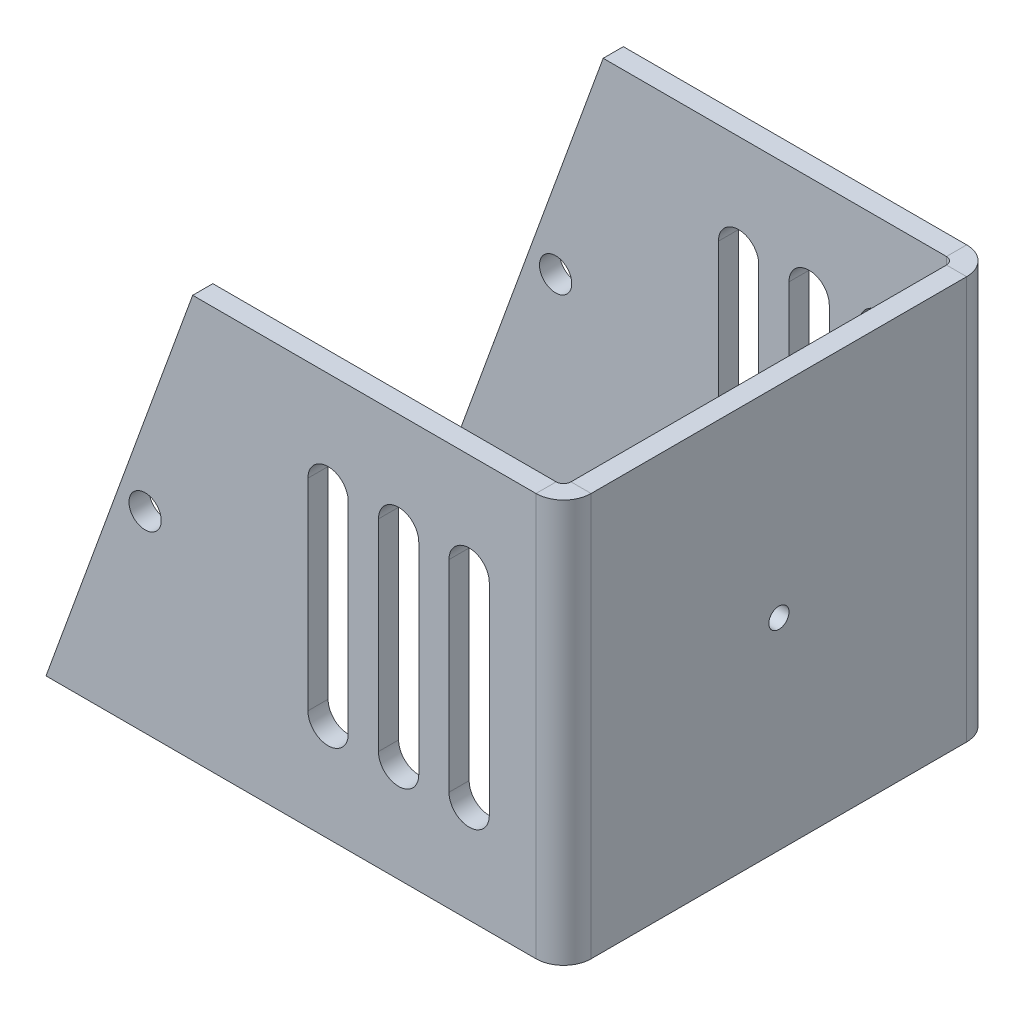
ISO-10303-21;
HEADER;
FILE_DESCRIPTION(('STEP AP214'),'2;1');
FILE_NAME('part.step','',(''),(''),'','','');
FILE_SCHEMA(('AUTOMOTIVE_DESIGN { 1 0 10303 214 1 1 1 1 }'));
ENDSEC;
DATA;
#1=APPLICATION_CONTEXT('core data for automotive mechanical design processes');
#2=APPLICATION_PROTOCOL_DEFINITION('international standard','automotive_design',2000,#1);
#3=PRODUCT_CONTEXT('',#1,'mechanical');
#4=PRODUCT('Part','Part','',(#3));
#5=PRODUCT_RELATED_PRODUCT_CATEGORY('part','',(#4));
#6=PRODUCT_DEFINITION_FORMATION('','',#4);
#7=PRODUCT_DEFINITION_CONTEXT('part definition',#1,'design');
#8=PRODUCT_DEFINITION('design','',#6,#7);
#9=PRODUCT_DEFINITION_SHAPE('','',#8);
#10=(LENGTH_UNIT() NAMED_UNIT(*) SI_UNIT(.MILLI.,.METRE.));
#11=(NAMED_UNIT(*) PLANE_ANGLE_UNIT() SI_UNIT($,.RADIAN.));
#12=(NAMED_UNIT(*) SI_UNIT($,.STERADIAN.) SOLID_ANGLE_UNIT());
#13=UNCERTAINTY_MEASURE_WITH_UNIT(LENGTH_MEASURE(1.E-05),#10,'distance_accuracy_value','');
#14=(GEOMETRIC_REPRESENTATION_CONTEXT(3) GLOBAL_UNCERTAINTY_ASSIGNED_CONTEXT((#13)) GLOBAL_UNIT_ASSIGNED_CONTEXT((#10,
#11,#12)) REPRESENTATION_CONTEXT('',''));
#15=CARTESIAN_POINT('',(0.,0.,0.));
#16=DIRECTION('',(0.,0.,1.));
#17=DIRECTION('',(1.,0.,0.));
#18=AXIS2_PLACEMENT_3D('',#15,#16,#17);
#19=CARTESIAN_POINT('',(51.3726775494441,40.000211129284,-34.0684362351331));
#20=DIRECTION('',(1.,0.,0.));
#21=DIRECTION('',(0.,0.,-1.));
#22=AXIS2_PLACEMENT_3D('',#19,#20,#21);
#23=PLANE('',#22);
#24=CARTESIAN_POINT('',(51.3726775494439,20.,21.372677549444));
#25=DIRECTION('',(-1.,0.,0.));
#26=DIRECTION('',(0.,0.,1.));
#27=AXIS2_PLACEMENT_3D('',#24,#25,#26);
#28=CIRCLE('',#27,0.999999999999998);
#29=CARTESIAN_POINT('',(51.3726775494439,20.,22.372677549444));
#30=VERTEX_POINT('',#29);
#31=EDGE_CURVE('E337',#30,#30,#28,.T.);
#32=ORIENTED_EDGE('',*,*,#31,.T.);
#33=EDGE_LOOP('',(#32));
#34=FACE_BOUND('',#33,.T.);
#35=DIRECTION('',(0.,0.,-1.));
#36=VECTOR('',#35,1.);
#37=CARTESIAN_POINT('',(51.3726775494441,40.000211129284,-34.0684362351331));
#38=LINE('',#37,#36);
#39=CARTESIAN_POINT('',(51.3726775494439,40.000211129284,40.008755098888));
#40=VERTEX_POINT('',#39);
#41=CARTESIAN_POINT('',(51.3726775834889,40.000211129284,2.73660000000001));
#42=VERTEX_POINT('',#41);
#43=EDGE_CURVE('E58',#40,#42,#38,.T.);
#44=ORIENTED_EDGE('',*,*,#43,.F.);
#45=DIRECTION('',(0.,-1.,0.));
#46=VECTOR('',#45,1.);
#47=CARTESIAN_POINT('',(51.3726775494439,40.000211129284,40.008755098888));
#48=LINE('',#47,#46);
#49=CARTESIAN_POINT('',(51.3726775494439,0.,40.008755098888));
#50=VERTEX_POINT('',#49);
#51=EDGE_CURVE('E50',#40,#50,#48,.T.);
#52=ORIENTED_EDGE('',*,*,#51,.T.);
#53=DIRECTION('',(0.,0.,1.));
#54=VECTOR('',#53,1.);
#55=CARTESIAN_POINT('',(51.3726775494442,0.,-48.627322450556));
#56=LINE('',#55,#54);
#57=CARTESIAN_POINT('',(51.372677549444,0.,2.73660000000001));
#58=VERTEX_POINT('',#57);
#59=EDGE_CURVE('E66',#58,#50,#56,.T.);
#60=ORIENTED_EDGE('',*,*,#59,.F.);
#61=DIRECTION('',(0.,-1.,0.));
#62=VECTOR('',#61,1.);
#63=CARTESIAN_POINT('',(51.372677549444,40.000211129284,2.73660000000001));
#64=LINE('',#63,#62);
#65=EDGE_CURVE('E471',#42,#58,#64,.T.);
#66=ORIENTED_EDGE('',*,*,#65,.F.);
#67=EDGE_LOOP('',(#44,#52,#60,#66));
#68=FACE_BOUND('',#67,.T.);
#69=ADVANCED_FACE('F41',(#34,#68),#23,.T.);
#70=CARTESIAN_POINT('',(49.3726775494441,40.000211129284,-34.0684362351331));
#71=DIRECTION('',(0.,-1.,0.));
#72=DIRECTION('',(1.,0.,0.));
#73=AXIS2_PLACEMENT_3D('',#70,#71,#72);
#74=PLANE('',#73);
#75=DIRECTION('',(-1.,0.,0.));
#76=VECTOR('',#75,1.);
#77=CARTESIAN_POINT('',(49.3726775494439,40.000211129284,40.008755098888));
#78=LINE('',#77,#76);
#79=CARTESIAN_POINT('',(49.3726775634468,40.000211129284,40.008755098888));
#80=VERTEX_POINT('',#79);
#81=EDGE_CURVE('E12',#40,#80,#78,.T.);
#82=ORIENTED_EDGE('',*,*,#81,.F.);
#83=ORIENTED_EDGE('',*,*,#43,.T.);
#84=DIRECTION('',(-1.,0.,0.));
#85=VECTOR('',#84,1.);
#86=CARTESIAN_POINT('',(49.372677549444,40.000211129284,2.73660000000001));
#87=LINE('',#86,#85);
#88=CARTESIAN_POINT('',(49.3726776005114,40.000211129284,2.7366));
#89=VERTEX_POINT('',#88);
#90=EDGE_CURVE('E468',#42,#89,#87,.T.);
#91=ORIENTED_EDGE('',*,*,#90,.T.);
#92=DIRECTION('',(0.,0.,-1.));
#93=VECTOR('',#92,1.);
#94=CARTESIAN_POINT('',(49.3726775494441,40.000211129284,-34.0684362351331));
#95=LINE('',#94,#93);
#96=EDGE_CURVE('E45',#80,#89,#95,.T.);
#97=ORIENTED_EDGE('',*,*,#96,.F.);
#98=EDGE_LOOP('',(#82,#83,#91,#97));
#99=FACE_BOUND('',#98,.T.);
#100=ADVANCED_FACE('F43',(#99),#74,.F.);
#101=CARTESIAN_POINT('',(49.3726775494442,0.,-48.627322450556));
#102=DIRECTION('',(0.,1.,0.));
#103=DIRECTION('',(-1.,0.,0.));
#104=AXIS2_PLACEMENT_3D('',#101,#102,#103);
#105=PLANE('',#104);
#106=DIRECTION('',(1.,0.,0.));
#107=VECTOR('',#106,1.);
#108=CARTESIAN_POINT('',(49.3726775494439,0.,40.008755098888));
#109=LINE('',#108,#107);
#110=CARTESIAN_POINT('',(49.3726775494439,0.,40.008755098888));
#111=VERTEX_POINT('',#110);
#112=EDGE_CURVE('E478',#111,#50,#109,.T.);
#113=ORIENTED_EDGE('',*,*,#112,.F.);
#114=DIRECTION('',(0.,0.,1.));
#115=VECTOR('',#114,1.);
#116=CARTESIAN_POINT('',(49.3726775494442,0.,-48.627322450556));
#117=LINE('',#116,#115);
#118=CARTESIAN_POINT('',(49.3726776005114,0.,2.7366));
#119=VERTEX_POINT('',#118);
#120=EDGE_CURVE('E483',#119,#111,#117,.T.);
#121=ORIENTED_EDGE('',*,*,#120,.F.);
#122=DIRECTION('',(1.,0.,0.));
#123=VECTOR('',#122,1.);
#124=CARTESIAN_POINT('',(49.372677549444,0.,2.73660000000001));
#125=LINE('',#124,#123);
#126=EDGE_CURVE('E473',#119,#58,#125,.T.);
#127=ORIENTED_EDGE('',*,*,#126,.T.);
#128=ORIENTED_EDGE('',*,*,#59,.T.);
#129=EDGE_LOOP('',(#113,#121,#127,#128));
#130=FACE_BOUND('',#129,.T.);
#131=ADVANCED_FACE('F538',(#130),#105,.F.);
#132=CARTESIAN_POINT('',(49.3726775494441,40.000211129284,-34.0684362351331));
#133=DIRECTION('',(1.,0.,0.));
#134=DIRECTION('',(0.,0.,-1.));
#135=AXIS2_PLACEMENT_3D('',#132,#133,#134);
#136=PLANE('',#135);
#137=DIRECTION('',(0.,-1.,0.));
#138=VECTOR('',#137,1.);
#139=CARTESIAN_POINT('',(49.3726775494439,40.000211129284,40.008755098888));
#140=LINE('',#139,#138);
#141=EDGE_CURVE('E475',#80,#111,#140,.T.);
#142=ORIENTED_EDGE('',*,*,#141,.F.);
#143=ORIENTED_EDGE('',*,*,#96,.T.);
#144=DIRECTION('',(0.,-1.,0.));
#145=VECTOR('',#144,1.);
#146=CARTESIAN_POINT('',(49.372677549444,40.000211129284,2.73660000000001));
#147=LINE('',#146,#145);
#148=EDGE_CURVE('E465',#89,#119,#147,.T.);
#149=ORIENTED_EDGE('',*,*,#148,.T.);
#150=ORIENTED_EDGE('',*,*,#120,.T.);
#151=EDGE_LOOP('',(#142,#143,#149,#150));
#152=FACE_BOUND('',#151,.T.);
#153=CARTESIAN_POINT('',(49.3726775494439,20.,21.372677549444));
#154=DIRECTION('',(-1.,0.,0.));
#155=DIRECTION('',(0.,0.,1.));
#156=AXIS2_PLACEMENT_3D('',#153,#154,#155);
#157=CIRCLE('',#156,0.999999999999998);
#158=CARTESIAN_POINT('',(49.3726775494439,20.,22.372677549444));
#159=VERTEX_POINT('',#158);
#160=EDGE_CURVE('E462',#159,#159,#157,.T.);
#161=ORIENTED_EDGE('',*,*,#160,.F.);
#162=EDGE_LOOP('',(#161));
#163=FACE_BOUND('',#162,.T.);
#164=ADVANCED_FACE('F488',(#152,#163),#136,.F.);
#165=CARTESIAN_POINT('',(49.3726775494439,20.,21.372677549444));
#166=DIRECTION('',(1.,0.,0.));
#167=DIRECTION('',(0.,0.,-1.));
#168=AXIS2_PLACEMENT_3D('',#165,#166,#167);
#169=CYLINDRICAL_SURFACE('',#168,0.999999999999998);
#170=ORIENTED_EDGE('',*,*,#160,.T.);
#171=EDGE_LOOP('',(#170));
#172=FACE_BOUND('',#171,.T.);
#173=ORIENTED_EDGE('',*,*,#31,.F.);
#174=EDGE_LOOP('',(#173));
#175=FACE_BOUND('',#174,.T.);
#176=ADVANCED_FACE('F544',(#172,#175),#169,.F.);
#177=CARTESIAN_POINT('',(9.83646703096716,19.0694249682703,2.));
#178=DIRECTION('',(0.,0.,-1.));
#179=DIRECTION('',(-1.,0.,0.));
#180=AXIS2_PLACEMENT_3D('',#177,#178,#179);
#181=CYLINDRICAL_SURFACE('',#180,1.6);
#182=CARTESIAN_POINT('',(9.83646703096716,19.0694249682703,2.));
#183=DIRECTION('',(0.,0.,1.));
#184=DIRECTION('',(1.,0.,0.));
#185=AXIS2_PLACEMENT_3D('',#182,#183,#184);
#186=CIRCLE('',#185,1.6);
#187=CARTESIAN_POINT('',(11.4364670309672,19.0694249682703,2.));
#188=VERTEX_POINT('',#187);
#189=EDGE_CURVE('E449',#188,#188,#186,.T.);
#190=ORIENTED_EDGE('',*,*,#189,.T.);
#191=EDGE_LOOP('',(#190));
#192=FACE_BOUND('',#191,.T.);
#193=CARTESIAN_POINT('',(9.83646703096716,19.0694249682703,0.));
#194=DIRECTION('',(0.,0.,1.));
#195=DIRECTION('',(1.,0.,0.));
#196=AXIS2_PLACEMENT_3D('',#193,#194,#195);
#197=CIRCLE('',#196,1.6);
#198=CARTESIAN_POINT('',(11.4364670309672,19.0694249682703,0.));
#199=VERTEX_POINT('',#198);
#200=EDGE_CURVE('E344',#199,#199,#197,.T.);
#201=ORIENTED_EDGE('',*,*,#200,.F.);
#202=EDGE_LOOP('',(#201));
#203=FACE_BOUND('',#202,.T.);
#204=ADVANCED_FACE('F547',(#192,#203),#181,.F.);
#205=CARTESIAN_POINT('',(42.,10.,-8.));
#206=DIRECTION('',(0.,0.,1.));
#207=DIRECTION('',(1.,0.,0.));
#208=AXIS2_PLACEMENT_3D('',#205,#206,#207);
#209=CYLINDRICAL_SURFACE('',#208,2.);
#210=CARTESIAN_POINT('',(42.,10.,0.));
#211=DIRECTION('',(0.,0.,-1.));
#212=DIRECTION('',(-1.,0.,0.));
#213=AXIS2_PLACEMENT_3D('',#210,#211,#212);
#214=CIRCLE('',#213,2.);
#215=CARTESIAN_POINT('',(44.,10.,0.));
#216=VERTEX_POINT('',#215);
#217=CARTESIAN_POINT('',(40.,10.,0.));
#218=VERTEX_POINT('',#217);
#219=EDGE_CURVE('E446',#216,#218,#214,.T.);
#220=ORIENTED_EDGE('',*,*,#219,.T.);
#221=DIRECTION('',(0.,0.,1.));
#222=VECTOR('',#221,1.);
#223=CARTESIAN_POINT('',(40.,10.,-8.));
#224=LINE('',#223,#222);
#225=CARTESIAN_POINT('',(40.,10.,2.));
#226=VERTEX_POINT('',#225);
#227=EDGE_CURVE('E444',#218,#226,#224,.T.);
#228=ORIENTED_EDGE('',*,*,#227,.T.);
#229=CARTESIAN_POINT('',(42.,10.,2.));
#230=DIRECTION('',(0.,0.,1.));
#231=DIRECTION('',(-1.,0.,0.));
#232=AXIS2_PLACEMENT_3D('',#229,#230,#231);
#233=CIRCLE('',#232,2.);
#234=CARTESIAN_POINT('',(44.,10.,2.));
#235=VERTEX_POINT('',#234);
#236=EDGE_CURVE('E441',#226,#235,#233,.T.);
#237=ORIENTED_EDGE('',*,*,#236,.T.);
#238=DIRECTION('',(0.,0.,1.));
#239=VECTOR('',#238,1.);
#240=CARTESIAN_POINT('',(44.,10.,-8.));
#241=LINE('',#240,#239);
#242=EDGE_CURVE('E437',#216,#235,#241,.T.);
#243=ORIENTED_EDGE('',*,*,#242,.F.);
#244=EDGE_LOOP('',(#220,#228,#237,#243));
#245=FACE_BOUND('',#244,.T.);
#246=ADVANCED_FACE('F801',(#245),#209,.F.);
#247=CARTESIAN_POINT('',(44.,30.000211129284,-8.));
#248=DIRECTION('',(1.,0.,0.));
#249=DIRECTION('',(0.,0.,-1.));
#250=AXIS2_PLACEMENT_3D('',#247,#248,#249);
#251=PLANE('',#250);
#252=DIRECTION('',(0.,-1.,0.));
#253=VECTOR('',#252,1.);
#254=CARTESIAN_POINT('',(44.,40.000211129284,0.));
#255=LINE('',#254,#253);
#256=CARTESIAN_POINT('',(44.,30.000211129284,0.));
#257=VERTEX_POINT('',#256);
#258=EDGE_CURVE('E439',#257,#216,#255,.T.);
#259=ORIENTED_EDGE('',*,*,#258,.T.);
#260=ORIENTED_EDGE('',*,*,#242,.T.);
#261=DIRECTION('',(0.,1.,0.));
#262=VECTOR('',#261,1.);
#263=CARTESIAN_POINT('',(44.,30.000211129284,2.));
#264=LINE('',#263,#262);
#265=CARTESIAN_POINT('',(44.,30.000211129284,2.));
#266=VERTEX_POINT('',#265);
#267=EDGE_CURVE('E434',#235,#266,#264,.T.);
#268=ORIENTED_EDGE('',*,*,#267,.T.);
#269=DIRECTION('',(0.,0.,1.));
#270=VECTOR('',#269,1.);
#271=CARTESIAN_POINT('',(44.,30.000211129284,-8.));
#272=LINE('',#271,#270);
#273=EDGE_CURVE('E430',#257,#266,#272,.T.);
#274=ORIENTED_EDGE('',*,*,#273,.F.);
#275=EDGE_LOOP('',(#259,#260,#268,#274));
#276=FACE_BOUND('',#275,.T.);
#277=ADVANCED_FACE('F809',(#276),#251,.F.);
#278=CARTESIAN_POINT('',(42.,30.000211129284,-8.));
#279=DIRECTION('',(0.,0.,1.));
#280=DIRECTION('',(1.,0.,0.));
#281=AXIS2_PLACEMENT_3D('',#278,#279,#280);
#282=CYLINDRICAL_SURFACE('',#281,2.);
#283=CARTESIAN_POINT('',(42.,30.000211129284,0.));
#284=DIRECTION('',(0.,0.,-1.));
#285=DIRECTION('',(-1.,0.,0.));
#286=AXIS2_PLACEMENT_3D('',#283,#284,#285);
#287=CIRCLE('',#286,2.);
#288=CARTESIAN_POINT('',(40.,30.000211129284,0.));
#289=VERTEX_POINT('',#288);
#290=EDGE_CURVE('E432',#289,#257,#287,.T.);
#291=ORIENTED_EDGE('',*,*,#290,.T.);
#292=ORIENTED_EDGE('',*,*,#273,.T.);
#293=CARTESIAN_POINT('',(42.,30.000211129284,2.));
#294=DIRECTION('',(0.,0.,1.));
#295=DIRECTION('',(-1.,0.,0.));
#296=AXIS2_PLACEMENT_3D('',#293,#294,#295);
#297=CIRCLE('',#296,2.);
#298=CARTESIAN_POINT('',(40.,30.000211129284,2.));
#299=VERTEX_POINT('',#298);
#300=EDGE_CURVE('E428',#266,#299,#297,.T.);
#301=ORIENTED_EDGE('',*,*,#300,.T.);
#302=DIRECTION('',(0.,0.,1.));
#303=VECTOR('',#302,1.);
#304=CARTESIAN_POINT('',(40.,30.000211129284,-8.));
#305=LINE('',#304,#303);
#306=EDGE_CURVE('E423',#289,#299,#305,.T.);
#307=ORIENTED_EDGE('',*,*,#306,.F.);
#308=EDGE_LOOP('',(#291,#292,#301,#307));
#309=FACE_BOUND('',#308,.T.);
#310=ADVANCED_FACE('F817',(#309),#282,.F.);
#311=CARTESIAN_POINT('',(40.,30.000211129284,-8.));
#312=DIRECTION('',(-1.,0.,0.));
#313=DIRECTION('',(0.,0.,1.));
#314=AXIS2_PLACEMENT_3D('',#311,#312,#313);
#315=PLANE('',#314);
#316=DIRECTION('',(0.,1.,0.));
#317=VECTOR('',#316,1.);
#318=CARTESIAN_POINT('',(40.,40.000211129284,0.));
#319=LINE('',#318,#317);
#320=EDGE_CURVE('E426',#218,#289,#319,.T.);
#321=ORIENTED_EDGE('',*,*,#320,.T.);
#322=ORIENTED_EDGE('',*,*,#306,.T.);
#323=DIRECTION('',(0.,-1.,0.));
#324=VECTOR('',#323,1.);
#325=CARTESIAN_POINT('',(40.,30.000211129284,2.));
#326=LINE('',#325,#324);
#327=EDGE_CURVE('E420',#299,#226,#326,.T.);
#328=ORIENTED_EDGE('',*,*,#327,.T.);
#329=ORIENTED_EDGE('',*,*,#227,.F.);
#330=EDGE_LOOP('',(#321,#322,#328,#329));
#331=FACE_BOUND('',#330,.T.);
#332=ADVANCED_FACE('F825',(#331),#315,.F.);
#333=CARTESIAN_POINT('',(35.,10.,-8.));
#334=DIRECTION('',(0.,0.,1.));
#335=DIRECTION('',(1.,0.,0.));
#336=AXIS2_PLACEMENT_3D('',#333,#334,#335);
#337=CYLINDRICAL_SURFACE('',#336,2.);
#338=CARTESIAN_POINT('',(35.,10.,0.));
#339=DIRECTION('',(0.,0.,-1.));
#340=DIRECTION('',(-1.,0.,0.));
#341=AXIS2_PLACEMENT_3D('',#338,#339,#340);
#342=CIRCLE('',#341,2.);
#343=CARTESIAN_POINT('',(37.,10.,0.));
#344=VERTEX_POINT('',#343);
#345=CARTESIAN_POINT('',(33.,10.,0.));
#346=VERTEX_POINT('',#345);
#347=EDGE_CURVE('E417',#344,#346,#342,.T.);
#348=ORIENTED_EDGE('',*,*,#347,.T.);
#349=DIRECTION('',(0.,0.,1.));
#350=VECTOR('',#349,1.);
#351=CARTESIAN_POINT('',(33.,10.,-8.));
#352=LINE('',#351,#350);
#353=CARTESIAN_POINT('',(33.,10.,2.));
#354=VERTEX_POINT('',#353);
#355=EDGE_CURVE('E415',#346,#354,#352,.T.);
#356=ORIENTED_EDGE('',*,*,#355,.T.);
#357=CARTESIAN_POINT('',(35.,10.,2.));
#358=DIRECTION('',(0.,0.,1.));
#359=DIRECTION('',(-1.,0.,0.));
#360=AXIS2_PLACEMENT_3D('',#357,#358,#359);
#361=CIRCLE('',#360,2.);
#362=CARTESIAN_POINT('',(37.,10.,2.));
#363=VERTEX_POINT('',#362);
#364=EDGE_CURVE('E412',#354,#363,#361,.T.);
#365=ORIENTED_EDGE('',*,*,#364,.T.);
#366=DIRECTION('',(0.,0.,1.));
#367=VECTOR('',#366,1.);
#368=CARTESIAN_POINT('',(37.,10.,-8.));
#369=LINE('',#368,#367);
#370=EDGE_CURVE('E408',#344,#363,#369,.T.);
#371=ORIENTED_EDGE('',*,*,#370,.F.);
#372=EDGE_LOOP('',(#348,#356,#365,#371));
#373=FACE_BOUND('',#372,.T.);
#374=ADVANCED_FACE('F833',(#373),#337,.F.);
#375=CARTESIAN_POINT('',(37.,30.000211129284,-8.));
#376=DIRECTION('',(1.,0.,0.));
#377=DIRECTION('',(0.,0.,-1.));
#378=AXIS2_PLACEMENT_3D('',#375,#376,#377);
#379=PLANE('',#378);
#380=DIRECTION('',(0.,-1.,0.));
#381=VECTOR('',#380,1.);
#382=CARTESIAN_POINT('',(37.,40.000211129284,0.));
#383=LINE('',#382,#381);
#384=CARTESIAN_POINT('',(37.,30.000211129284,0.));
#385=VERTEX_POINT('',#384);
#386=EDGE_CURVE('E410',#385,#344,#383,.T.);
#387=ORIENTED_EDGE('',*,*,#386,.T.);
#388=ORIENTED_EDGE('',*,*,#370,.T.);
#389=DIRECTION('',(0.,1.,0.));
#390=VECTOR('',#389,1.);
#391=CARTESIAN_POINT('',(37.,30.000211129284,2.));
#392=LINE('',#391,#390);
#393=CARTESIAN_POINT('',(37.,30.000211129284,2.));
#394=VERTEX_POINT('',#393);
#395=EDGE_CURVE('E405',#363,#394,#392,.T.);
#396=ORIENTED_EDGE('',*,*,#395,.T.);
#397=DIRECTION('',(0.,0.,1.));
#398=VECTOR('',#397,1.);
#399=CARTESIAN_POINT('',(37.,30.000211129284,-8.));
#400=LINE('',#399,#398);
#401=EDGE_CURVE('E401',#385,#394,#400,.T.);
#402=ORIENTED_EDGE('',*,*,#401,.F.);
#403=EDGE_LOOP('',(#387,#388,#396,#402));
#404=FACE_BOUND('',#403,.T.);
#405=ADVANCED_FACE('F841',(#404),#379,.F.);
#406=CARTESIAN_POINT('',(35.,30.000211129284,-8.));
#407=DIRECTION('',(0.,0.,1.));
#408=DIRECTION('',(1.,0.,0.));
#409=AXIS2_PLACEMENT_3D('',#406,#407,#408);
#410=CYLINDRICAL_SURFACE('',#409,2.);
#411=CARTESIAN_POINT('',(35.,30.000211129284,0.));
#412=DIRECTION('',(0.,0.,-1.));
#413=DIRECTION('',(-1.,0.,0.));
#414=AXIS2_PLACEMENT_3D('',#411,#412,#413);
#415=CIRCLE('',#414,2.);
#416=CARTESIAN_POINT('',(33.,30.000211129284,0.));
#417=VERTEX_POINT('',#416);
#418=EDGE_CURVE('E403',#417,#385,#415,.T.);
#419=ORIENTED_EDGE('',*,*,#418,.T.);
#420=ORIENTED_EDGE('',*,*,#401,.T.);
#421=CARTESIAN_POINT('',(35.,30.000211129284,2.));
#422=DIRECTION('',(0.,0.,1.));
#423=DIRECTION('',(-1.,0.,0.));
#424=AXIS2_PLACEMENT_3D('',#421,#422,#423);
#425=CIRCLE('',#424,2.);
#426=CARTESIAN_POINT('',(33.,30.000211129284,2.));
#427=VERTEX_POINT('',#426);
#428=EDGE_CURVE('E399',#394,#427,#425,.T.);
#429=ORIENTED_EDGE('',*,*,#428,.T.);
#430=DIRECTION('',(0.,0.,1.));
#431=VECTOR('',#430,1.);
#432=CARTESIAN_POINT('',(33.,30.000211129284,-8.));
#433=LINE('',#432,#431);
#434=EDGE_CURVE('E394',#417,#427,#433,.T.);
#435=ORIENTED_EDGE('',*,*,#434,.F.);
#436=EDGE_LOOP('',(#419,#420,#429,#435));
#437=FACE_BOUND('',#436,.T.);
#438=ADVANCED_FACE('F849',(#437),#410,.F.);
#439=CARTESIAN_POINT('',(33.,30.000211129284,-8.));
#440=DIRECTION('',(-1.,0.,0.));
#441=DIRECTION('',(0.,0.,1.));
#442=AXIS2_PLACEMENT_3D('',#439,#440,#441);
#443=PLANE('',#442);
#444=DIRECTION('',(0.,1.,0.));
#445=VECTOR('',#444,1.);
#446=CARTESIAN_POINT('',(33.,40.000211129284,0.));
#447=LINE('',#446,#445);
#448=EDGE_CURVE('E397',#346,#417,#447,.T.);
#449=ORIENTED_EDGE('',*,*,#448,.T.);
#450=ORIENTED_EDGE('',*,*,#434,.T.);
#451=DIRECTION('',(0.,-1.,0.));
#452=VECTOR('',#451,1.);
#453=CARTESIAN_POINT('',(33.,30.000211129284,2.));
#454=LINE('',#453,#452);
#455=EDGE_CURVE('E391',#427,#354,#454,.T.);
#456=ORIENTED_EDGE('',*,*,#455,.T.);
#457=ORIENTED_EDGE('',*,*,#355,.F.);
#458=EDGE_LOOP('',(#449,#450,#456,#457));
#459=FACE_BOUND('',#458,.T.);
#460=ADVANCED_FACE('F857',(#459),#443,.F.);
#461=CARTESIAN_POINT('',(28.,10.,-8.));
#462=DIRECTION('',(0.,0.,1.));
#463=DIRECTION('',(1.,0.,0.));
#464=AXIS2_PLACEMENT_3D('',#461,#462,#463);
#465=CYLINDRICAL_SURFACE('',#464,2.);
#466=CARTESIAN_POINT('',(28.,10.,0.));
#467=DIRECTION('',(0.,0.,-1.));
#468=DIRECTION('',(-1.,0.,0.));
#469=AXIS2_PLACEMENT_3D('',#466,#467,#468);
#470=CIRCLE('',#469,2.);
#471=CARTESIAN_POINT('',(30.,10.,0.));
#472=VERTEX_POINT('',#471);
#473=CARTESIAN_POINT('',(26.,10.,0.));
#474=VERTEX_POINT('',#473);
#475=EDGE_CURVE('E388',#472,#474,#470,.T.);
#476=ORIENTED_EDGE('',*,*,#475,.T.);
#477=DIRECTION('',(0.,0.,1.));
#478=VECTOR('',#477,1.);
#479=CARTESIAN_POINT('',(26.,10.,-8.));
#480=LINE('',#479,#478);
#481=CARTESIAN_POINT('',(26.,10.,2.));
#482=VERTEX_POINT('',#481);
#483=EDGE_CURVE('E386',#474,#482,#480,.T.);
#484=ORIENTED_EDGE('',*,*,#483,.T.);
#485=CARTESIAN_POINT('',(28.,10.,2.));
#486=DIRECTION('',(0.,0.,1.));
#487=DIRECTION('',(-1.,0.,0.));
#488=AXIS2_PLACEMENT_3D('',#485,#486,#487);
#489=CIRCLE('',#488,2.);
#490=CARTESIAN_POINT('',(30.,10.,2.));
#491=VERTEX_POINT('',#490);
#492=EDGE_CURVE('E383',#482,#491,#489,.T.);
#493=ORIENTED_EDGE('',*,*,#492,.T.);
#494=DIRECTION('',(0.,0.,1.));
#495=VECTOR('',#494,1.);
#496=CARTESIAN_POINT('',(30.,10.,-8.));
#497=LINE('',#496,#495);
#498=EDGE_CURVE('E379',#472,#491,#497,.T.);
#499=ORIENTED_EDGE('',*,*,#498,.F.);
#500=EDGE_LOOP('',(#476,#484,#493,#499));
#501=FACE_BOUND('',#500,.T.);
#502=ADVANCED_FACE('F865',(#501),#465,.F.);
#503=CARTESIAN_POINT('',(30.,30.000211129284,-8.));
#504=DIRECTION('',(1.,0.,0.));
#505=DIRECTION('',(0.,0.,-1.));
#506=AXIS2_PLACEMENT_3D('',#503,#504,#505);
#507=PLANE('',#506);
#508=DIRECTION('',(0.,-1.,0.));
#509=VECTOR('',#508,1.);
#510=CARTESIAN_POINT('',(30.,40.000211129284,0.));
#511=LINE('',#510,#509);
#512=CARTESIAN_POINT('',(30.,30.000211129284,0.));
#513=VERTEX_POINT('',#512);
#514=EDGE_CURVE('E381',#513,#472,#511,.T.);
#515=ORIENTED_EDGE('',*,*,#514,.T.);
#516=ORIENTED_EDGE('',*,*,#498,.T.);
#517=DIRECTION('',(0.,1.,0.));
#518=VECTOR('',#517,1.);
#519=CARTESIAN_POINT('',(30.,30.000211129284,2.));
#520=LINE('',#519,#518);
#521=CARTESIAN_POINT('',(30.,30.000211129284,2.));
#522=VERTEX_POINT('',#521);
#523=EDGE_CURVE('E376',#491,#522,#520,.T.);
#524=ORIENTED_EDGE('',*,*,#523,.T.);
#525=DIRECTION('',(0.,0.,1.));
#526=VECTOR('',#525,1.);
#527=CARTESIAN_POINT('',(30.,30.000211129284,-8.));
#528=LINE('',#527,#526);
#529=EDGE_CURVE('E372',#513,#522,#528,.T.);
#530=ORIENTED_EDGE('',*,*,#529,.F.);
#531=EDGE_LOOP('',(#515,#516,#524,#530));
#532=FACE_BOUND('',#531,.T.);
#533=ADVANCED_FACE('F873',(#532),#507,.F.);
#534=CARTESIAN_POINT('',(28.,30.000211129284,-8.));
#535=DIRECTION('',(0.,0.,1.));
#536=DIRECTION('',(1.,0.,0.));
#537=AXIS2_PLACEMENT_3D('',#534,#535,#536);
#538=CYLINDRICAL_SURFACE('',#537,2.);
#539=CARTESIAN_POINT('',(28.,30.000211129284,0.));
#540=DIRECTION('',(0.,0.,-1.));
#541=DIRECTION('',(-1.,0.,0.));
#542=AXIS2_PLACEMENT_3D('',#539,#540,#541);
#543=CIRCLE('',#542,2.);
#544=CARTESIAN_POINT('',(26.,30.000211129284,0.));
#545=VERTEX_POINT('',#544);
#546=EDGE_CURVE('E374',#545,#513,#543,.T.);
#547=ORIENTED_EDGE('',*,*,#546,.T.);
#548=ORIENTED_EDGE('',*,*,#529,.T.);
#549=CARTESIAN_POINT('',(28.,30.000211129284,2.));
#550=DIRECTION('',(0.,0.,1.));
#551=DIRECTION('',(-1.,0.,0.));
#552=AXIS2_PLACEMENT_3D('',#549,#550,#551);
#553=CIRCLE('',#552,2.);
#554=CARTESIAN_POINT('',(26.,30.000211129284,2.));
#555=VERTEX_POINT('',#554);
#556=EDGE_CURVE('E370',#522,#555,#553,.T.);
#557=ORIENTED_EDGE('',*,*,#556,.T.);
#558=DIRECTION('',(0.,0.,1.));
#559=VECTOR('',#558,1.);
#560=CARTESIAN_POINT('',(26.,30.000211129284,-8.));
#561=LINE('',#560,#559);
#562=EDGE_CURVE('E365',#545,#555,#561,.T.);
#563=ORIENTED_EDGE('',*,*,#562,.F.);
#564=EDGE_LOOP('',(#547,#548,#557,#563));
#565=FACE_BOUND('',#564,.T.);
#566=ADVANCED_FACE('F530',(#565),#538,.F.);
#567=CARTESIAN_POINT('',(26.,30.000211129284,-8.));
#568=DIRECTION('',(-1.,0.,0.));
#569=DIRECTION('',(0.,0.,1.));
#570=AXIS2_PLACEMENT_3D('',#567,#568,#569);
#571=PLANE('',#570);
#572=DIRECTION('',(0.,1.,0.));
#573=VECTOR('',#572,1.);
#574=CARTESIAN_POINT('',(26.,40.000211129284,0.));
#575=LINE('',#574,#573);
#576=EDGE_CURVE('E368',#474,#545,#575,.T.);
#577=ORIENTED_EDGE('',*,*,#576,.T.);
#578=ORIENTED_EDGE('',*,*,#562,.T.);
#579=DIRECTION('',(0.,-1.,0.));
#580=VECTOR('',#579,1.);
#581=CARTESIAN_POINT('',(26.,30.000211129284,2.));
#582=LINE('',#581,#580);
#583=EDGE_CURVE('E362',#555,#482,#582,.T.);
#584=ORIENTED_EDGE('',*,*,#583,.T.);
#585=ORIENTED_EDGE('',*,*,#483,.F.);
#586=EDGE_LOOP('',(#577,#578,#584,#585));
#587=FACE_BOUND('',#586,.T.);
#588=ADVANCED_FACE('F523',(#587),#571,.F.);
#589=CARTESIAN_POINT('',(0.,0.,2.));
#590=DIRECTION('',(0.93969262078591,-0.342020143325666,0.));
#591=DIRECTION('',(0.342020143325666,0.93969262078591,0.));
#592=AXIS2_PLACEMENT_3D('',#589,#590,#591);
#593=PLANE('',#592);
#594=DIRECTION('',(-0.342020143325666,-0.939692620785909,0.));
#595=VECTOR('',#594,1.);
#596=CARTESIAN_POINT('',(0.,0.,0.));
#597=LINE('',#596,#595);
#598=CARTESIAN_POINT('',(14.5588862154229,40.000211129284,0.));
#599=VERTEX_POINT('',#598);
#600=CARTESIAN_POINT('',(0.,0.,0.));
#601=VERTEX_POINT('',#600);
#602=EDGE_CURVE('E359',#599,#601,#597,.T.);
#603=ORIENTED_EDGE('',*,*,#602,.T.);
#604=DIRECTION('',(0.,0.,-1.));
#605=VECTOR('',#604,1.);
#606=CARTESIAN_POINT('',(0.,0.,2.));
#607=LINE('',#606,#605);
#608=CARTESIAN_POINT('',(0.,0.,2.));
#609=VERTEX_POINT('',#608);
#610=EDGE_CURVE('E338',#609,#601,#607,.T.);
#611=ORIENTED_EDGE('',*,*,#610,.F.);
#612=DIRECTION('',(-0.342020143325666,-0.939692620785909,0.));
#613=VECTOR('',#612,1.);
#614=CARTESIAN_POINT('',(0.,0.,2.));
#615=LINE('',#614,#613);
#616=CARTESIAN_POINT('',(14.5588862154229,40.000211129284,2.));
#617=VERTEX_POINT('',#616);
#618=EDGE_CURVE('E351',#617,#609,#615,.T.);
#619=ORIENTED_EDGE('',*,*,#618,.F.);
#620=DIRECTION('',(0.,0.,-1.));
#621=VECTOR('',#620,1.);
#622=CARTESIAN_POINT('',(14.5588862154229,40.000211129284,2.));
#623=LINE('',#622,#621);
#624=EDGE_CURVE('E356',#617,#599,#623,.T.);
#625=ORIENTED_EDGE('',*,*,#624,.T.);
#626=EDGE_LOOP('',(#603,#611,#619,#625));
#627=FACE_BOUND('',#626,.T.);
#628=ADVANCED_FACE('F521',(#627),#593,.F.);
#629=CARTESIAN_POINT('',(14.5588862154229,40.000211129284,2.));
#630=DIRECTION('',(0.,0.,-1.));
#631=DIRECTION('',(-1.,0.,0.));
#632=AXIS2_PLACEMENT_3D('',#629,#630,#631);
#633=PLANE('',#632);
#634=DIRECTION('',(0.,-1.,0.));
#635=VECTOR('',#634,1.);
#636=CARTESIAN_POINT('',(48.636077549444,40.000211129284,2.));
#637=LINE('',#636,#635);
#638=CARTESIAN_POINT('',(48.636077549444,40.000211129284,1.99999998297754));
#639=VERTEX_POINT('',#638);
#640=CARTESIAN_POINT('',(48.636077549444,0.,2.));
#641=VERTEX_POINT('',#640);
#642=EDGE_CURVE('E334',#639,#641,#637,.T.);
#643=ORIENTED_EDGE('',*,*,#642,.F.);
#644=DIRECTION('',(-1.,0.,0.));
#645=VECTOR('',#644,1.);
#646=CARTESIAN_POINT('',(14.5588862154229,40.000211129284,2.));
#647=LINE('',#646,#645);
#648=EDGE_CURVE('E354',#639,#617,#647,.T.);
#649=ORIENTED_EDGE('',*,*,#648,.T.);
#650=ORIENTED_EDGE('',*,*,#618,.T.);
#651=DIRECTION('',(1.,0.,0.));
#652=VECTOR('',#651,1.);
#653=CARTESIAN_POINT('',(0.,0.,2.));
#654=LINE('',#653,#652);
#655=EDGE_CURVE('E349',#609,#641,#654,.T.);
#656=ORIENTED_EDGE('',*,*,#655,.T.);
#657=EDGE_LOOP('',(#643,#649,#650,#656));
#658=FACE_BOUND('',#657,.T.);
#659=ORIENTED_EDGE('',*,*,#583,.F.);
#660=ORIENTED_EDGE('',*,*,#556,.F.);
#661=ORIENTED_EDGE('',*,*,#523,.F.);
#662=ORIENTED_EDGE('',*,*,#492,.F.);
#663=EDGE_LOOP('',(#659,#660,#661,#662));
#664=FACE_BOUND('',#663,.T.);
#665=ORIENTED_EDGE('',*,*,#455,.F.);
#666=ORIENTED_EDGE('',*,*,#428,.F.);
#667=ORIENTED_EDGE('',*,*,#395,.F.);
#668=ORIENTED_EDGE('',*,*,#364,.F.);
#669=EDGE_LOOP('',(#665,#666,#667,#668));
#670=FACE_BOUND('',#669,.T.);
#671=ORIENTED_EDGE('',*,*,#327,.F.);
#672=ORIENTED_EDGE('',*,*,#300,.F.);
#673=ORIENTED_EDGE('',*,*,#267,.F.);
#674=ORIENTED_EDGE('',*,*,#236,.F.);
#675=EDGE_LOOP('',(#671,#672,#673,#674));
#676=FACE_BOUND('',#675,.T.);
#677=ORIENTED_EDGE('',*,*,#189,.F.);
#678=EDGE_LOOP('',(#677));
#679=FACE_BOUND('',#678,.T.);
#680=ADVANCED_FACE('F513',(#658,#664,#670,#676,#679),#633,.F.);
#681=CARTESIAN_POINT('',(14.5588862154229,40.000211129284,2.));
#682=DIRECTION('',(0.,-1.,0.));
#683=DIRECTION('',(0.,0.,-1.));
#684=AXIS2_PLACEMENT_3D('',#681,#682,#683);
#685=PLANE('',#684);
#686=DIRECTION('',(0.,0.,1.));
#687=VECTOR('',#686,1.);
#688=CARTESIAN_POINT('',(48.636077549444,40.000211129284,2.));
#689=LINE('',#688,#687);
#690=CARTESIAN_POINT('',(48.636077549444,40.000211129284,0.));
#691=VERTEX_POINT('',#690);
#692=EDGE_CURVE('E452',#691,#639,#689,.T.);
#693=ORIENTED_EDGE('',*,*,#692,.F.);
#694=DIRECTION('',(-1.,0.,0.));
#695=VECTOR('',#694,1.);
#696=CARTESIAN_POINT('',(14.5588862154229,40.000211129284,0.));
#697=LINE('',#696,#695);
#698=EDGE_CURVE('E347',#691,#599,#697,.T.);
#699=ORIENTED_EDGE('',*,*,#698,.T.);
#700=ORIENTED_EDGE('',*,*,#624,.F.);
#701=ORIENTED_EDGE('',*,*,#648,.F.);
#702=EDGE_LOOP('',(#693,#699,#700,#701));
#703=FACE_BOUND('',#702,.T.);
#704=ADVANCED_FACE('F517',(#703),#685,.F.);
#705=CARTESIAN_POINT('',(14.5588862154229,40.000211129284,0.));
#706=DIRECTION('',(0.,0.,-1.));
#707=DIRECTION('',(-1.,0.,0.));
#708=AXIS2_PLACEMENT_3D('',#705,#706,#707);
#709=PLANE('',#708);
#710=ORIENTED_EDGE('',*,*,#546,.F.);
#711=ORIENTED_EDGE('',*,*,#576,.F.);
#712=ORIENTED_EDGE('',*,*,#475,.F.);
#713=ORIENTED_EDGE('',*,*,#514,.F.);
#714=EDGE_LOOP('',(#710,#711,#712,#713));
#715=FACE_BOUND('',#714,.T.);
#716=ORIENTED_EDGE('',*,*,#418,.F.);
#717=ORIENTED_EDGE('',*,*,#448,.F.);
#718=ORIENTED_EDGE('',*,*,#347,.F.);
#719=ORIENTED_EDGE('',*,*,#386,.F.);
#720=EDGE_LOOP('',(#716,#717,#718,#719));
#721=FACE_BOUND('',#720,.T.);
#722=ORIENTED_EDGE('',*,*,#290,.F.);
#723=ORIENTED_EDGE('',*,*,#320,.F.);
#724=ORIENTED_EDGE('',*,*,#219,.F.);
#725=ORIENTED_EDGE('',*,*,#258,.F.);
#726=EDGE_LOOP('',(#722,#723,#724,#725));
#727=FACE_BOUND('',#726,.T.);
#728=ORIENTED_EDGE('',*,*,#200,.T.);
#729=EDGE_LOOP('',(#728));
#730=FACE_BOUND('',#729,.T.);
#731=ORIENTED_EDGE('',*,*,#698,.F.);
#732=DIRECTION('',(0.,-1.,0.));
#733=VECTOR('',#732,1.);
#734=CARTESIAN_POINT('',(48.636077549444,40.000211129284,0.));
#735=LINE('',#734,#733);
#736=CARTESIAN_POINT('',(48.636077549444,0.,0.));
#737=VERTEX_POINT('',#736);
#738=EDGE_CURVE('E341',#691,#737,#735,.T.);
#739=ORIENTED_EDGE('',*,*,#738,.T.);
#740=DIRECTION('',(1.,0.,0.));
#741=VECTOR('',#740,1.);
#742=CARTESIAN_POINT('',(0.,0.,0.));
#743=LINE('',#742,#741);
#744=EDGE_CURVE('E335',#601,#737,#743,.T.);
#745=ORIENTED_EDGE('',*,*,#744,.F.);
#746=ORIENTED_EDGE('',*,*,#602,.F.);
#747=EDGE_LOOP('',(#731,#739,#745,#746));
#748=FACE_BOUND('',#747,.T.);
#749=ADVANCED_FACE('F500',(#715,#721,#727,#730,#748),#709,.T.);
#750=CARTESIAN_POINT('',(0.,0.,2.));
#751=DIRECTION('',(0.,1.,0.));
#752=DIRECTION('',(0.,0.,1.));
#753=AXIS2_PLACEMENT_3D('',#750,#751,#752);
#754=PLANE('',#753);
#755=DIRECTION('',(0.,0.,-1.));
#756=VECTOR('',#755,1.);
#757=CARTESIAN_POINT('',(48.636077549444,0.,2.));
#758=LINE('',#757,#756);
#759=EDGE_CURVE('E455',#641,#737,#758,.T.);
#760=ORIENTED_EDGE('',*,*,#759,.F.);
#761=ORIENTED_EDGE('',*,*,#655,.F.);
#762=ORIENTED_EDGE('',*,*,#610,.T.);
#763=ORIENTED_EDGE('',*,*,#744,.T.);
#764=EDGE_LOOP('',(#760,#761,#762,#763));
#765=FACE_BOUND('',#764,.T.);
#766=ADVANCED_FACE('F508',(#765),#754,.F.);
#767=CARTESIAN_POINT('',(48.636077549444,40.000211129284,2.73660003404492));
#768=DIRECTION('',(0.,-1.,0.));
#769=DIRECTION('',(0.,0.,-1.));
#770=AXIS2_PLACEMENT_3D('',#767,#768,#769);
#771=PLANE('',#770);
#772=ORIENTED_EDGE('',*,*,#90,.F.);
#773=CARTESIAN_POINT('',(48.636077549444,40.000211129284,2.7366));
#774=DIRECTION('',(0.,1.,0.));
#775=DIRECTION('',(-1.,0.,0.));
#776=AXIS2_PLACEMENT_3D('',#773,#774,#775);
#777=CIRCLE('',#776,2.73660003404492);
#778=EDGE_CURVE('E322',#42,#691,#777,.T.);
#779=ORIENTED_EDGE('',*,*,#778,.T.);
#780=ORIENTED_EDGE('',*,*,#692,.T.);
#781=CARTESIAN_POINT('',(48.636077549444,40.000211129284,2.73660003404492));
#782=DIRECTION('',(0.,1.,0.));
#783=DIRECTION('',(0.,0.,1.));
#784=AXIS2_PLACEMENT_3D('',#781,#782,#783);
#785=CIRCLE('',#784,0.736600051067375);
#786=EDGE_CURVE('E326',#89,#639,#785,.T.);
#787=ORIENTED_EDGE('',*,*,#786,.F.);
#788=EDGE_LOOP('',(#772,#779,#780,#787));
#789=FACE_BOUND('',#788,.T.);
#790=ADVANCED_FACE('F494',(#789),#771,.F.);
#791=CARTESIAN_POINT('',(48.636077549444,0.,2.73660003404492));
#792=DIRECTION('',(0.,1.,0.));
#793=DIRECTION('',(-1.,0.,0.));
#794=AXIS2_PLACEMENT_3D('',#791,#792,#793);
#795=PLANE('',#794);
#796=ORIENTED_EDGE('',*,*,#759,.T.);
#797=CARTESIAN_POINT('',(48.636077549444,0.,2.7366));
#798=DIRECTION('',(0.,1.,0.));
#799=DIRECTION('',(-1.,0.,0.));
#800=AXIS2_PLACEMENT_3D('',#797,#798,#799);
#801=CIRCLE('',#800,2.73660003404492);
#802=EDGE_CURVE('E323',#737,#58,#801,.F.);
#803=ORIENTED_EDGE('',*,*,#802,.T.);
#804=ORIENTED_EDGE('',*,*,#126,.F.);
#805=CARTESIAN_POINT('',(48.636077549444,0.,2.73660003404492));
#806=DIRECTION('',(0.,-1.,0.));
#807=DIRECTION('',(1.,0.,0.));
#808=AXIS2_PLACEMENT_3D('',#805,#806,#807);
#809=CIRCLE('',#808,0.736600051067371);
#810=EDGE_CURVE('E331',#641,#119,#809,.T.);
#811=ORIENTED_EDGE('',*,*,#810,.F.);
#812=EDGE_LOOP('',(#796,#803,#804,#811));
#813=FACE_BOUND('',#812,.T.);
#814=ADVANCED_FACE('F506',(#813),#795,.F.);
#815=CARTESIAN_POINT('',(48.636077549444,-20.1428642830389,2.7366));
#816=DIRECTION('',(0.,1.,0.));
#817=DIRECTION('',(-1.,0.,0.));
#818=AXIS2_PLACEMENT_3D('',#815,#816,#817);
#819=CYLINDRICAL_SURFACE('',#818,0.736600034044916);
#820=ORIENTED_EDGE('',*,*,#810,.T.);
#821=ORIENTED_EDGE('',*,*,#148,.F.);
#822=ORIENTED_EDGE('',*,*,#786,.T.);
#823=ORIENTED_EDGE('',*,*,#642,.T.);
#824=EDGE_LOOP('',(#820,#821,#822,#823));
#825=FACE_BOUND('',#824,.T.);
#826=ADVANCED_FACE('F511',(#825),#819,.F.);
#827=CARTESIAN_POINT('',(48.636077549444,-20.1428642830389,2.7366));
#828=DIRECTION('',(0.,1.,0.));
#829=DIRECTION('',(-1.,0.,0.));
#830=AXIS2_PLACEMENT_3D('',#827,#828,#829);
#831=CYLINDRICAL_SURFACE('',#830,2.73660003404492);
#832=ORIENTED_EDGE('',*,*,#802,.F.);
#833=ORIENTED_EDGE('',*,*,#738,.F.);
#834=ORIENTED_EDGE('',*,*,#778,.F.);
#835=ORIENTED_EDGE('',*,*,#65,.T.);
#836=EDGE_LOOP('',(#832,#833,#834,#835));
#837=FACE_BOUND('',#836,.T.);
#838=ADVANCED_FACE('F498',(#837),#831,.T.);
#839=CARTESIAN_POINT('',(48.636077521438,40.000211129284,40.008755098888));
#840=DIRECTION('',(0.,-1.,0.));
#841=DIRECTION('',(0.,0.,-1.));
#842=AXIS2_PLACEMENT_3D('',#839,#840,#841);
#843=PLANE('',#842);
#844=DIRECTION('',(0.,0.,-1.));
#845=VECTOR('',#844,1.);
#846=CARTESIAN_POINT('',(48.6360775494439,40.000211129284,40.745355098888));
#847=LINE('',#846,#845);
#848=CARTESIAN_POINT('',(48.6360775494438,40.000211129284,42.745355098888));
#849=VERTEX_POINT('',#848);
#850=CARTESIAN_POINT('',(48.6360775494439,40.000211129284,40.745355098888));
#851=VERTEX_POINT('',#850);
#852=EDGE_CURVE('E1016',#849,#851,#847,.T.);
#853=ORIENTED_EDGE('',*,*,#852,.F.);
#854=CARTESIAN_POINT('',(48.6360775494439,40.000211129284,40.008755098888));
#855=DIRECTION('',(0.,1.,0.));
#856=DIRECTION('',(-1.,0.,0.));
#857=AXIS2_PLACEMENT_3D('',#854,#855,#856);
#858=CIRCLE('',#857,2.73660002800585);
#859=EDGE_CURVE('E313',#849,#40,#858,.T.);
#860=ORIENTED_EDGE('',*,*,#859,.T.);
#861=ORIENTED_EDGE('',*,*,#81,.T.);
#862=CARTESIAN_POINT('',(48.636077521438,40.000211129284,40.008755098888));
#863=DIRECTION('',(0.,1.,0.));
#864=DIRECTION('',(0.,0.,1.));
#865=AXIS2_PLACEMENT_3D('',#862,#863,#864);
#866=CIRCLE('',#865,0.736600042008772);
#867=EDGE_CURVE('E312',#851,#80,#866,.T.);
#868=ORIENTED_EDGE('',*,*,#867,.F.);
#869=EDGE_LOOP('',(#853,#860,#861,#868));
#870=FACE_BOUND('',#869,.T.);
#871=ADVANCED_FACE('F596',(#870),#843,.F.);
#872=CARTESIAN_POINT('',(48.636077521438,0.,40.008755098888));
#873=DIRECTION('',(0.,1.,0.));
#874=DIRECTION('',(-1.,0.,0.));
#875=AXIS2_PLACEMENT_3D('',#872,#873,#874);
#876=PLANE('',#875);
#877=ORIENTED_EDGE('',*,*,#112,.T.);
#878=CARTESIAN_POINT('',(48.6360775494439,0.,40.008755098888));
#879=DIRECTION('',(0.,1.,0.));
#880=DIRECTION('',(-1.,0.,0.));
#881=AXIS2_PLACEMENT_3D('',#878,#879,#880);
#882=CIRCLE('',#881,2.73660002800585);
#883=CARTESIAN_POINT('',(48.6360775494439,0.,42.745355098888));
#884=VERTEX_POINT('',#883);
#885=EDGE_CURVE('E310',#50,#884,#882,.F.);
#886=ORIENTED_EDGE('',*,*,#885,.T.);
#887=DIRECTION('',(0.,0.,1.));
#888=VECTOR('',#887,1.);
#889=CARTESIAN_POINT('',(48.6360775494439,0.,40.745355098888));
#890=LINE('',#889,#888);
#891=CARTESIAN_POINT('',(48.6360775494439,0.,40.7453551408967));
#892=VERTEX_POINT('',#891);
#893=EDGE_CURVE('E285',#892,#884,#890,.T.);
#894=ORIENTED_EDGE('',*,*,#893,.F.);
#895=CARTESIAN_POINT('',(48.636077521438,0.,40.008755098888));
#896=DIRECTION('',(0.,-1.,0.));
#897=DIRECTION('',(1.,0.,0.));
#898=AXIS2_PLACEMENT_3D('',#895,#896,#897);
#899=CIRCLE('',#898,0.736600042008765);
#900=EDGE_CURVE('E319',#111,#892,#899,.T.);
#901=ORIENTED_EDGE('',*,*,#900,.F.);
#902=EDGE_LOOP('',(#877,#886,#894,#901));
#903=FACE_BOUND('',#902,.T.);
#904=ADVANCED_FACE('F604',(#903),#876,.F.);
#905=CARTESIAN_POINT('',(48.6360775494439,-20.1428642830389,40.008755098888));
#906=DIRECTION('',(0.,1.,0.));
#907=DIRECTION('',(-1.,0.,0.));
#908=AXIS2_PLACEMENT_3D('',#905,#906,#907);
#909=CYLINDRICAL_SURFACE('',#908,0.736600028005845);
#910=ORIENTED_EDGE('',*,*,#900,.T.);
#911=DIRECTION('',(0.,-1.,0.));
#912=VECTOR('',#911,1.);
#913=CARTESIAN_POINT('',(48.6360775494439,40.000211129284,40.745355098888));
#914=LINE('',#913,#912);
#915=EDGE_CURVE('E1026',#851,#892,#914,.T.);
#916=ORIENTED_EDGE('',*,*,#915,.F.);
#917=ORIENTED_EDGE('',*,*,#867,.T.);
#918=ORIENTED_EDGE('',*,*,#141,.T.);
#919=EDGE_LOOP('',(#910,#916,#917,#918));
#920=FACE_BOUND('',#919,.T.);
#921=ADVANCED_FACE('F613',(#920),#909,.F.);
#922=CARTESIAN_POINT('',(48.6360775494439,-20.1428642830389,40.008755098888));
#923=DIRECTION('',(0.,1.,0.));
#924=DIRECTION('',(-1.,0.,0.));
#925=AXIS2_PLACEMENT_3D('',#922,#923,#924);
#926=CYLINDRICAL_SURFACE('',#925,2.73660002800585);
#927=ORIENTED_EDGE('',*,*,#885,.F.);
#928=ORIENTED_EDGE('',*,*,#51,.F.);
#929=ORIENTED_EDGE('',*,*,#859,.F.);
#930=DIRECTION('',(0.,-1.,0.));
#931=VECTOR('',#930,1.);
#932=CARTESIAN_POINT('',(48.6360775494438,40.000211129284,42.745355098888));
#933=LINE('',#932,#931);
#934=EDGE_CURVE('E304',#849,#884,#933,.T.);
#935=ORIENTED_EDGE('',*,*,#934,.T.);
#936=EDGE_LOOP('',(#927,#928,#929,#935));
#937=FACE_BOUND('',#936,.T.);
#938=ADVANCED_FACE('F622',(#937),#926,.T.);
#939=CARTESIAN_POINT('',(-1.38777878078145E-13,0.,40.7453550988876));
#940=DIRECTION('',(0.939692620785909,-0.342020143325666,0.));
#941=DIRECTION('',(-0.342020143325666,-0.93969262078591,0.));
#942=AXIS2_PLACEMENT_3D('',#939,#940,#941);
#943=PLANE('',#942);
#944=DIRECTION('',(0.342020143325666,0.939692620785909,0.));
#945=VECTOR('',#944,1.);
#946=CARTESIAN_POINT('',(-1.52655665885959E-13,0.,42.7453550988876));
#947=LINE('',#946,#945);
#948=CARTESIAN_POINT('',(-1.52655665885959E-13,0.,42.7453550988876));
#949=VERTEX_POINT('',#948);
#950=CARTESIAN_POINT('',(14.5588862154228,40.000211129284,42.7453550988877));
#951=VERTEX_POINT('',#950);
#952=EDGE_CURVE('E295',#949,#951,#947,.T.);
#953=ORIENTED_EDGE('',*,*,#952,.T.);
#954=DIRECTION('',(0.,0.,1.));
#955=VECTOR('',#954,1.);
#956=CARTESIAN_POINT('',(14.5588862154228,40.000211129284,40.7453550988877));
#957=LINE('',#956,#955);
#958=CARTESIAN_POINT('',(14.5588862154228,40.000211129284,40.7453550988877));
#959=VERTEX_POINT('',#958);
#960=EDGE_CURVE('E316',#959,#951,#957,.T.);
#961=ORIENTED_EDGE('',*,*,#960,.F.);
#962=DIRECTION('',(0.342020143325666,0.939692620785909,0.));
#963=VECTOR('',#962,1.);
#964=CARTESIAN_POINT('',(-1.38777878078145E-13,0.,40.7453550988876));
#965=LINE('',#964,#963);
#966=CARTESIAN_POINT('',(-1.38777878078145E-13,0.,40.7453550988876));
#967=VERTEX_POINT('',#966);
#968=EDGE_CURVE('E297',#967,#959,#965,.T.);
#969=ORIENTED_EDGE('',*,*,#968,.F.);
#970=DIRECTION('',(0.,0.,1.));
#971=VECTOR('',#970,1.);
#972=CARTESIAN_POINT('',(-1.38777878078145E-13,0.,40.7453550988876));
#973=LINE('',#972,#971);
#974=EDGE_CURVE('E282',#967,#949,#973,.T.);
#975=ORIENTED_EDGE('',*,*,#974,.T.);
#976=EDGE_LOOP('',(#953,#961,#969,#975));
#977=FACE_BOUND('',#976,.T.);
#978=ADVANCED_FACE('F293',(#977),#943,.F.);
#979=CARTESIAN_POINT('',(9.83646703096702,19.0694249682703,40.7453550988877));
#980=DIRECTION('',(0.,0.,1.));
#981=DIRECTION('',(1.,0.,0.));
#982=AXIS2_PLACEMENT_3D('',#979,#980,#981);
#983=CYLINDRICAL_SURFACE('',#982,1.60000000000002);
#984=CARTESIAN_POINT('',(9.83646703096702,19.0694249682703,40.7453550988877));
#985=DIRECTION('',(0.,0.,-1.));
#986=DIRECTION('',(1.,0.,0.));
#987=AXIS2_PLACEMENT_3D('',#984,#985,#986);
#988=CIRCLE('',#987,1.60000000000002);
#989=CARTESIAN_POINT('',(11.436467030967,19.0694249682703,40.7453550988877));
#990=VERTEX_POINT('',#989);
#991=EDGE_CURVE('E298',#990,#990,#988,.T.);
#992=ORIENTED_EDGE('',*,*,#991,.T.);
#993=EDGE_LOOP('',(#992));
#994=FACE_BOUND('',#993,.T.);
#995=CARTESIAN_POINT('',(9.83646703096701,19.0694249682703,42.7453550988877));
#996=DIRECTION('',(0.,0.,-1.));
#997=DIRECTION('',(1.,0.,0.));
#998=AXIS2_PLACEMENT_3D('',#995,#996,#997);
#999=CIRCLE('',#998,1.60000000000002);
#1000=CARTESIAN_POINT('',(11.436467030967,19.0694249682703,42.7453550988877));
#1001=VERTEX_POINT('',#1000);
#1002=EDGE_CURVE('E290',#1001,#1001,#999,.T.);
#1003=ORIENTED_EDGE('',*,*,#1002,.F.);
#1004=EDGE_LOOP('',(#1003));
#1005=FACE_BOUND('',#1004,.T.);
#1006=ADVANCED_FACE('F640',(#994,#1005),#983,.F.);
#1007=CARTESIAN_POINT('',(27.9999999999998,30.000211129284,50.7453550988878));
#1008=DIRECTION('',(0.,0.,-1.));
#1009=DIRECTION('',(-1.,0.,0.));
#1010=AXIS2_PLACEMENT_3D('',#1007,#1008,#1009);
#1011=CYLINDRICAL_SURFACE('',#1010,2.);
#1012=CARTESIAN_POINT('',(27.9999999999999,30.000211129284,42.7453550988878));
#1013=DIRECTION('',(0.,0.,1.));
#1014=DIRECTION('',(1.,0.,0.));
#1015=AXIS2_PLACEMENT_3D('',#1012,#1013,#1014);
#1016=CIRCLE('',#1015,2.);
#1017=CARTESIAN_POINT('',(29.9999999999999,30.000211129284,42.7453550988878));
#1018=VERTEX_POINT('',#1017);
#1019=CARTESIAN_POINT('',(25.9999999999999,30.000211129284,42.7453550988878));
#1020=VERTEX_POINT('',#1019);
#1021=EDGE_CURVE('E1119',#1018,#1020,#1016,.T.);
#1022=ORIENTED_EDGE('',*,*,#1021,.T.);
#1023=DIRECTION('',(0.,0.,-1.));
#1024=VECTOR('',#1023,1.);
#1025=CARTESIAN_POINT('',(25.9999999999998,30.000211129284,50.7453550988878));
#1026=LINE('',#1025,#1024);
#1027=CARTESIAN_POINT('',(25.9999999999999,30.000211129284,40.7453550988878));
#1028=VERTEX_POINT('',#1027);
#1029=EDGE_CURVE('E1117',#1020,#1028,#1026,.T.);
#1030=ORIENTED_EDGE('',*,*,#1029,.T.);
#1031=CARTESIAN_POINT('',(27.9999999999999,30.000211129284,40.7453550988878));
#1032=DIRECTION('',(0.,0.,-1.));
#1033=DIRECTION('',(-1.,0.,0.));
#1034=AXIS2_PLACEMENT_3D('',#1031,#1032,#1033);
#1035=CIRCLE('',#1034,2.);
#1036=CARTESIAN_POINT('',(29.9999999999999,30.000211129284,40.7453550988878));
#1037=VERTEX_POINT('',#1036);
#1038=EDGE_CURVE('E1114',#1028,#1037,#1035,.T.);
#1039=ORIENTED_EDGE('',*,*,#1038,.T.);
#1040=DIRECTION('',(0.,0.,-1.));
#1041=VECTOR('',#1040,1.);
#1042=CARTESIAN_POINT('',(29.9999999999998,30.000211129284,50.7453550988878));
#1043=LINE('',#1042,#1041);
#1044=EDGE_CURVE('E1110',#1018,#1037,#1043,.T.);
#1045=ORIENTED_EDGE('',*,*,#1044,.F.);
#1046=EDGE_LOOP('',(#1022,#1030,#1039,#1045));
#1047=FACE_BOUND('',#1046,.T.);
#1048=ADVANCED_FACE('F647',(#1047),#1011,.F.);
#1049=CARTESIAN_POINT('',(29.9999999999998,30.000211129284,50.7453550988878));
#1050=DIRECTION('',(1.,0.,0.));
#1051=DIRECTION('',(0.,0.,-1.));
#1052=AXIS2_PLACEMENT_3D('',#1049,#1050,#1051);
#1053=PLANE('',#1052);
#1054=DIRECTION('',(0.,1.,0.));
#1055=VECTOR('',#1054,1.);
#1056=CARTESIAN_POINT('',(29.9999999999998,40.000211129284,42.7453550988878));
#1057=LINE('',#1056,#1055);
#1058=CARTESIAN_POINT('',(29.9999999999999,9.99999999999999,42.7453550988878));
#1059=VERTEX_POINT('',#1058);
#1060=EDGE_CURVE('E1112',#1059,#1018,#1057,.T.);
#1061=ORIENTED_EDGE('',*,*,#1060,.T.);
#1062=ORIENTED_EDGE('',*,*,#1044,.T.);
#1063=DIRECTION('',(0.,-1.,0.));
#1064=VECTOR('',#1063,1.);
#1065=CARTESIAN_POINT('',(29.9999999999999,30.000211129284,40.7453550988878));
#1066=LINE('',#1065,#1064);
#1067=CARTESIAN_POINT('',(29.9999999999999,9.99999999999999,40.7453550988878));
#1068=VERTEX_POINT('',#1067);
#1069=EDGE_CURVE('E1107',#1037,#1068,#1066,.T.);
#1070=ORIENTED_EDGE('',*,*,#1069,.T.);
#1071=DIRECTION('',(0.,0.,-1.));
#1072=VECTOR('',#1071,1.);
#1073=CARTESIAN_POINT('',(29.9999999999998,9.99999999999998,50.7453550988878));
#1074=LINE('',#1073,#1072);
#1075=EDGE_CURVE('E1103',#1059,#1068,#1074,.T.);
#1076=ORIENTED_EDGE('',*,*,#1075,.F.);
#1077=EDGE_LOOP('',(#1061,#1062,#1070,#1076));
#1078=FACE_BOUND('',#1077,.T.);
#1079=ADVANCED_FACE('F655',(#1078),#1053,.F.);
#1080=CARTESIAN_POINT('',(27.9999999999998,9.99999999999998,50.7453550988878));
#1081=DIRECTION('',(0.,0.,-1.));
#1082=DIRECTION('',(-1.,0.,0.));
#1083=AXIS2_PLACEMENT_3D('',#1080,#1081,#1082);
#1084=CYLINDRICAL_SURFACE('',#1083,2.);
#1085=CARTESIAN_POINT('',(27.9999999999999,9.99999999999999,42.7453550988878));
#1086=DIRECTION('',(0.,0.,1.));
#1087=DIRECTION('',(1.,0.,0.));
#1088=AXIS2_PLACEMENT_3D('',#1085,#1086,#1087);
#1089=CIRCLE('',#1088,2.);
#1090=CARTESIAN_POINT('',(25.9999999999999,9.99999999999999,42.7453550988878));
#1091=VERTEX_POINT('',#1090);
#1092=EDGE_CURVE('E1105',#1091,#1059,#1089,.T.);
#1093=ORIENTED_EDGE('',*,*,#1092,.T.);
#1094=ORIENTED_EDGE('',*,*,#1075,.T.);
#1095=CARTESIAN_POINT('',(27.9999999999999,9.99999999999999,40.7453550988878));
#1096=DIRECTION('',(0.,0.,-1.));
#1097=DIRECTION('',(-1.,0.,0.));
#1098=AXIS2_PLACEMENT_3D('',#1095,#1096,#1097);
#1099=CIRCLE('',#1098,2.);
#1100=CARTESIAN_POINT('',(25.9999999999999,9.99999999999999,40.7453550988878));
#1101=VERTEX_POINT('',#1100);
#1102=EDGE_CURVE('E1101',#1068,#1101,#1099,.T.);
#1103=ORIENTED_EDGE('',*,*,#1102,.T.);
#1104=DIRECTION('',(0.,0.,-1.));
#1105=VECTOR('',#1104,1.);
#1106=CARTESIAN_POINT('',(25.9999999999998,9.99999999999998,50.7453550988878));
#1107=LINE('',#1106,#1105);
#1108=EDGE_CURVE('E1096',#1091,#1101,#1107,.T.);
#1109=ORIENTED_EDGE('',*,*,#1108,.F.);
#1110=EDGE_LOOP('',(#1093,#1094,#1103,#1109));
#1111=FACE_BOUND('',#1110,.T.);
#1112=ADVANCED_FACE('F663',(#1111),#1084,.F.);
#1113=CARTESIAN_POINT('',(25.9999999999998,30.000211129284,50.7453550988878));
#1114=DIRECTION('',(-1.,0.,0.));
#1115=DIRECTION('',(0.,0.,1.));
#1116=AXIS2_PLACEMENT_3D('',#1113,#1114,#1115);
#1117=PLANE('',#1116);
#1118=DIRECTION('',(0.,-1.,0.));
#1119=VECTOR('',#1118,1.);
#1120=CARTESIAN_POINT('',(25.9999999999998,40.000211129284,42.7453550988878));
#1121=LINE('',#1120,#1119);
#1122=EDGE_CURVE('E1099',#1020,#1091,#1121,.T.);
#1123=ORIENTED_EDGE('',*,*,#1122,.T.);
#1124=ORIENTED_EDGE('',*,*,#1108,.T.);
#1125=DIRECTION('',(0.,1.,0.));
#1126=VECTOR('',#1125,1.);
#1127=CARTESIAN_POINT('',(25.9999999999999,30.000211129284,40.7453550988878));
#1128=LINE('',#1127,#1126);
#1129=EDGE_CURVE('E1093',#1101,#1028,#1128,.T.);
#1130=ORIENTED_EDGE('',*,*,#1129,.T.);
#1131=ORIENTED_EDGE('',*,*,#1029,.F.);
#1132=EDGE_LOOP('',(#1123,#1124,#1130,#1131));
#1133=FACE_BOUND('',#1132,.T.);
#1134=ADVANCED_FACE('F671',(#1133),#1117,.F.);
#1135=CARTESIAN_POINT('',(34.9999999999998,30.000211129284,50.7453550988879));
#1136=DIRECTION('',(0.,0.,-1.));
#1137=DIRECTION('',(-1.,0.,0.));
#1138=AXIS2_PLACEMENT_3D('',#1135,#1136,#1137);
#1139=CYLINDRICAL_SURFACE('',#1138,2.);
#1140=CARTESIAN_POINT('',(34.9999999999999,30.000211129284,42.7453550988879));
#1141=DIRECTION('',(0.,0.,1.));
#1142=DIRECTION('',(1.,0.,0.));
#1143=AXIS2_PLACEMENT_3D('',#1140,#1141,#1142);
#1144=CIRCLE('',#1143,2.);
#1145=CARTESIAN_POINT('',(36.9999999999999,30.000211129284,42.7453550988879));
#1146=VERTEX_POINT('',#1145);
#1147=CARTESIAN_POINT('',(32.9999999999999,30.000211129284,42.7453550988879));
#1148=VERTEX_POINT('',#1147);
#1149=EDGE_CURVE('E1090',#1146,#1148,#1144,.T.);
#1150=ORIENTED_EDGE('',*,*,#1149,.T.);
#1151=DIRECTION('',(0.,0.,-1.));
#1152=VECTOR('',#1151,1.);
#1153=CARTESIAN_POINT('',(32.9999999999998,30.000211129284,50.7453550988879));
#1154=LINE('',#1153,#1152);
#1155=CARTESIAN_POINT('',(32.9999999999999,30.000211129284,40.7453550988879));
#1156=VERTEX_POINT('',#1155);
#1157=EDGE_CURVE('E1088',#1148,#1156,#1154,.T.);
#1158=ORIENTED_EDGE('',*,*,#1157,.T.);
#1159=CARTESIAN_POINT('',(34.9999999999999,30.000211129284,40.7453550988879));
#1160=DIRECTION('',(0.,0.,-1.));
#1161=DIRECTION('',(-1.,0.,0.));
#1162=AXIS2_PLACEMENT_3D('',#1159,#1160,#1161);
#1163=CIRCLE('',#1162,2.);
#1164=CARTESIAN_POINT('',(36.9999999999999,30.000211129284,40.7453550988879));
#1165=VERTEX_POINT('',#1164);
#1166=EDGE_CURVE('E1085',#1156,#1165,#1163,.T.);
#1167=ORIENTED_EDGE('',*,*,#1166,.T.);
#1168=DIRECTION('',(0.,0.,-1.));
#1169=VECTOR('',#1168,1.);
#1170=CARTESIAN_POINT('',(36.9999999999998,30.000211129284,50.7453550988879));
#1171=LINE('',#1170,#1169);
#1172=EDGE_CURVE('E1081',#1146,#1165,#1171,.T.);
#1173=ORIENTED_EDGE('',*,*,#1172,.F.);
#1174=EDGE_LOOP('',(#1150,#1158,#1167,#1173));
#1175=FACE_BOUND('',#1174,.T.);
#1176=ADVANCED_FACE('F679',(#1175),#1139,.F.);
#1177=CARTESIAN_POINT('',(36.9999999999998,30.000211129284,50.7453550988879));
#1178=DIRECTION('',(1.,0.,0.));
#1179=DIRECTION('',(0.,0.,-1.));
#1180=AXIS2_PLACEMENT_3D('',#1177,#1178,#1179);
#1181=PLANE('',#1180);
#1182=DIRECTION('',(0.,1.,0.));
#1183=VECTOR('',#1182,1.);
#1184=CARTESIAN_POINT('',(36.9999999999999,40.000211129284,42.7453550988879));
#1185=LINE('',#1184,#1183);
#1186=CARTESIAN_POINT('',(36.9999999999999,9.99999999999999,42.7453550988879));
#1187=VERTEX_POINT('',#1186);
#1188=EDGE_CURVE('E1083',#1187,#1146,#1185,.T.);
#1189=ORIENTED_EDGE('',*,*,#1188,.T.);
#1190=ORIENTED_EDGE('',*,*,#1172,.T.);
#1191=DIRECTION('',(0.,-1.,0.));
#1192=VECTOR('',#1191,1.);
#1193=CARTESIAN_POINT('',(36.9999999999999,30.000211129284,40.7453550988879));
#1194=LINE('',#1193,#1192);
#1195=CARTESIAN_POINT('',(36.9999999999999,9.99999999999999,40.7453550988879));
#1196=VERTEX_POINT('',#1195);
#1197=EDGE_CURVE('E1078',#1165,#1196,#1194,.T.);
#1198=ORIENTED_EDGE('',*,*,#1197,.T.);
#1199=DIRECTION('',(0.,0.,-1.));
#1200=VECTOR('',#1199,1.);
#1201=CARTESIAN_POINT('',(36.9999999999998,9.99999999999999,50.7453550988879));
#1202=LINE('',#1201,#1200);
#1203=EDGE_CURVE('E1074',#1187,#1196,#1202,.T.);
#1204=ORIENTED_EDGE('',*,*,#1203,.F.);
#1205=EDGE_LOOP('',(#1189,#1190,#1198,#1204));
#1206=FACE_BOUND('',#1205,.T.);
#1207=ADVANCED_FACE('F687',(#1206),#1181,.F.);
#1208=CARTESIAN_POINT('',(34.9999999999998,9.99999999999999,50.7453550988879));
#1209=DIRECTION('',(0.,0.,-1.));
#1210=DIRECTION('',(-1.,0.,0.));
#1211=AXIS2_PLACEMENT_3D('',#1208,#1209,#1210);
#1212=CYLINDRICAL_SURFACE('',#1211,2.);
#1213=CARTESIAN_POINT('',(34.9999999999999,9.99999999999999,42.7453550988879));
#1214=DIRECTION('',(0.,0.,1.));
#1215=DIRECTION('',(1.,0.,0.));
#1216=AXIS2_PLACEMENT_3D('',#1213,#1214,#1215);
#1217=CIRCLE('',#1216,2.);
#1218=CARTESIAN_POINT('',(32.9999999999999,9.99999999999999,42.7453550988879));
#1219=VERTEX_POINT('',#1218);
#1220=EDGE_CURVE('E1076',#1219,#1187,#1217,.T.);
#1221=ORIENTED_EDGE('',*,*,#1220,.T.);
#1222=ORIENTED_EDGE('',*,*,#1203,.T.);
#1223=CARTESIAN_POINT('',(34.9999999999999,9.99999999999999,40.7453550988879));
#1224=DIRECTION('',(0.,0.,-1.));
#1225=DIRECTION('',(-1.,0.,0.));
#1226=AXIS2_PLACEMENT_3D('',#1223,#1224,#1225);
#1227=CIRCLE('',#1226,2.);
#1228=CARTESIAN_POINT('',(32.9999999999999,9.99999999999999,40.7453550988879));
#1229=VERTEX_POINT('',#1228);
#1230=EDGE_CURVE('E1072',#1196,#1229,#1227,.T.);
#1231=ORIENTED_EDGE('',*,*,#1230,.T.);
#1232=DIRECTION('',(0.,0.,-1.));
#1233=VECTOR('',#1232,1.);
#1234=CARTESIAN_POINT('',(32.9999999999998,9.99999999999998,50.7453550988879));
#1235=LINE('',#1234,#1233);
#1236=EDGE_CURVE('E1067',#1219,#1229,#1235,.T.);
#1237=ORIENTED_EDGE('',*,*,#1236,.F.);
#1238=EDGE_LOOP('',(#1221,#1222,#1231,#1237));
#1239=FACE_BOUND('',#1238,.T.);
#1240=ADVANCED_FACE('F695',(#1239),#1212,.F.);
#1241=CARTESIAN_POINT('',(32.9999999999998,30.000211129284,50.7453550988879));
#1242=DIRECTION('',(-1.,0.,0.));
#1243=DIRECTION('',(0.,0.,1.));
#1244=AXIS2_PLACEMENT_3D('',#1241,#1242,#1243);
#1245=PLANE('',#1244);
#1246=DIRECTION('',(0.,-1.,0.));
#1247=VECTOR('',#1246,1.);
#1248=CARTESIAN_POINT('',(32.9999999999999,40.000211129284,42.7453550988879));
#1249=LINE('',#1248,#1247);
#1250=EDGE_CURVE('E1070',#1148,#1219,#1249,.T.);
#1251=ORIENTED_EDGE('',*,*,#1250,.T.);
#1252=ORIENTED_EDGE('',*,*,#1236,.T.);
#1253=DIRECTION('',(0.,1.,0.));
#1254=VECTOR('',#1253,1.);
#1255=CARTESIAN_POINT('',(32.9999999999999,30.000211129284,40.7453550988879));
#1256=LINE('',#1255,#1254);
#1257=EDGE_CURVE('E1064',#1229,#1156,#1256,.T.);
#1258=ORIENTED_EDGE('',*,*,#1257,.T.);
#1259=ORIENTED_EDGE('',*,*,#1157,.F.);
#1260=EDGE_LOOP('',(#1251,#1252,#1258,#1259));
#1261=FACE_BOUND('',#1260,.T.);
#1262=ADVANCED_FACE('F703',(#1261),#1245,.F.);
#1263=CARTESIAN_POINT('',(41.9999999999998,30.000211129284,50.7453550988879));
#1264=DIRECTION('',(0.,0.,-1.));
#1265=DIRECTION('',(-1.,0.,0.));
#1266=AXIS2_PLACEMENT_3D('',#1263,#1264,#1265);
#1267=CYLINDRICAL_SURFACE('',#1266,2.);
#1268=CARTESIAN_POINT('',(41.9999999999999,30.000211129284,42.7453550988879));
#1269=DIRECTION('',(0.,0.,1.));
#1270=DIRECTION('',(1.,0.,0.));
#1271=AXIS2_PLACEMENT_3D('',#1268,#1269,#1270);
#1272=CIRCLE('',#1271,2.);
#1273=CARTESIAN_POINT('',(43.9999999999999,30.000211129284,42.7453550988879));
#1274=VERTEX_POINT('',#1273);
#1275=CARTESIAN_POINT('',(39.9999999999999,30.000211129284,42.7453550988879));
#1276=VERTEX_POINT('',#1275);
#1277=EDGE_CURVE('E1061',#1274,#1276,#1272,.T.);
#1278=ORIENTED_EDGE('',*,*,#1277,.T.);
#1279=DIRECTION('',(0.,0.,-1.));
#1280=VECTOR('',#1279,1.);
#1281=CARTESIAN_POINT('',(39.9999999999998,30.000211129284,50.7453550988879));
#1282=LINE('',#1281,#1280);
#1283=CARTESIAN_POINT('',(39.9999999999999,30.000211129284,40.7453550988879));
#1284=VERTEX_POINT('',#1283);
#1285=EDGE_CURVE('E1059',#1276,#1284,#1282,.T.);
#1286=ORIENTED_EDGE('',*,*,#1285,.T.);
#1287=CARTESIAN_POINT('',(41.9999999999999,30.000211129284,40.7453550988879));
#1288=DIRECTION('',(0.,0.,-1.));
#1289=DIRECTION('',(-1.,0.,0.));
#1290=AXIS2_PLACEMENT_3D('',#1287,#1288,#1289);
#1291=CIRCLE('',#1290,2.);
#1292=CARTESIAN_POINT('',(43.9999999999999,30.000211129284,40.7453550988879));
#1293=VERTEX_POINT('',#1292);
#1294=EDGE_CURVE('E1056',#1284,#1293,#1291,.T.);
#1295=ORIENTED_EDGE('',*,*,#1294,.T.);
#1296=DIRECTION('',(0.,0.,-1.));
#1297=VECTOR('',#1296,1.);
#1298=CARTESIAN_POINT('',(43.9999999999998,30.000211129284,50.7453550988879));
#1299=LINE('',#1298,#1297);
#1300=EDGE_CURVE('E1052',#1274,#1293,#1299,.T.);
#1301=ORIENTED_EDGE('',*,*,#1300,.F.);
#1302=EDGE_LOOP('',(#1278,#1286,#1295,#1301));
#1303=FACE_BOUND('',#1302,.T.);
#1304=ADVANCED_FACE('F711',(#1303),#1267,.F.);
#1305=CARTESIAN_POINT('',(43.9999999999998,30.000211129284,50.7453550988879));
#1306=DIRECTION('',(1.,0.,0.));
#1307=DIRECTION('',(0.,0.,-1.));
#1308=AXIS2_PLACEMENT_3D('',#1305,#1306,#1307);
#1309=PLANE('',#1308);
#1310=DIRECTION('',(0.,1.,0.));
#1311=VECTOR('',#1310,1.);
#1312=CARTESIAN_POINT('',(43.9999999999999,40.000211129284,42.7453550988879));
#1313=LINE('',#1312,#1311);
#1314=CARTESIAN_POINT('',(43.9999999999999,9.99999999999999,42.7453550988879));
#1315=VERTEX_POINT('',#1314);
#1316=EDGE_CURVE('E1054',#1315,#1274,#1313,.T.);
#1317=ORIENTED_EDGE('',*,*,#1316,.T.);
#1318=ORIENTED_EDGE('',*,*,#1300,.T.);
#1319=DIRECTION('',(0.,-1.,0.));
#1320=VECTOR('',#1319,1.);
#1321=CARTESIAN_POINT('',(43.9999999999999,30.000211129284,40.7453550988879));
#1322=LINE('',#1321,#1320);
#1323=CARTESIAN_POINT('',(43.9999999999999,9.99999999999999,40.7453550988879));
#1324=VERTEX_POINT('',#1323);
#1325=EDGE_CURVE('E1049',#1293,#1324,#1322,.T.);
#1326=ORIENTED_EDGE('',*,*,#1325,.T.);
#1327=DIRECTION('',(0.,0.,-1.));
#1328=VECTOR('',#1327,1.);
#1329=CARTESIAN_POINT('',(43.9999999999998,9.99999999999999,50.7453550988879));
#1330=LINE('',#1329,#1328);
#1331=EDGE_CURVE('E1045',#1315,#1324,#1330,.T.);
#1332=ORIENTED_EDGE('',*,*,#1331,.F.);
#1333=EDGE_LOOP('',(#1317,#1318,#1326,#1332));
#1334=FACE_BOUND('',#1333,.T.);
#1335=ADVANCED_FACE('F719',(#1334),#1309,.F.);
#1336=CARTESIAN_POINT('',(41.9999999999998,9.99999999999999,50.7453550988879));
#1337=DIRECTION('',(0.,0.,-1.));
#1338=DIRECTION('',(-1.,0.,0.));
#1339=AXIS2_PLACEMENT_3D('',#1336,#1337,#1338);
#1340=CYLINDRICAL_SURFACE('',#1339,2.);
#1341=CARTESIAN_POINT('',(41.9999999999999,9.99999999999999,42.7453550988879));
#1342=DIRECTION('',(0.,0.,1.));
#1343=DIRECTION('',(1.,0.,0.));
#1344=AXIS2_PLACEMENT_3D('',#1341,#1342,#1343);
#1345=CIRCLE('',#1344,2.);
#1346=CARTESIAN_POINT('',(39.9999999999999,9.99999999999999,42.7453550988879));
#1347=VERTEX_POINT('',#1346);
#1348=EDGE_CURVE('E1047',#1347,#1315,#1345,.T.);
#1349=ORIENTED_EDGE('',*,*,#1348,.T.);
#1350=ORIENTED_EDGE('',*,*,#1331,.T.);
#1351=CARTESIAN_POINT('',(41.9999999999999,9.99999999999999,40.7453550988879));
#1352=DIRECTION('',(0.,0.,-1.));
#1353=DIRECTION('',(-1.,0.,0.));
#1354=AXIS2_PLACEMENT_3D('',#1351,#1352,#1353);
#1355=CIRCLE('',#1354,2.);
#1356=CARTESIAN_POINT('',(39.9999999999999,9.99999999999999,40.7453550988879));
#1357=VERTEX_POINT('',#1356);
#1358=EDGE_CURVE('E1043',#1324,#1357,#1355,.T.);
#1359=ORIENTED_EDGE('',*,*,#1358,.T.);
#1360=DIRECTION('',(0.,0.,-1.));
#1361=VECTOR('',#1360,1.);
#1362=CARTESIAN_POINT('',(39.9999999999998,9.99999999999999,50.7453550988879));
#1363=LINE('',#1362,#1361);
#1364=EDGE_CURVE('E1038',#1347,#1357,#1363,.T.);
#1365=ORIENTED_EDGE('',*,*,#1364,.F.);
#1366=EDGE_LOOP('',(#1349,#1350,#1359,#1365));
#1367=FACE_BOUND('',#1366,.T.);
#1368=ADVANCED_FACE('F727',(#1367),#1340,.F.);
#1369=CARTESIAN_POINT('',(39.9999999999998,30.000211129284,50.7453550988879));
#1370=DIRECTION('',(-1.,0.,0.));
#1371=DIRECTION('',(0.,0.,1.));
#1372=AXIS2_PLACEMENT_3D('',#1369,#1370,#1371);
#1373=PLANE('',#1372);
#1374=DIRECTION('',(0.,-1.,0.));
#1375=VECTOR('',#1374,1.);
#1376=CARTESIAN_POINT('',(39.9999999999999,40.000211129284,42.7453550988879));
#1377=LINE('',#1376,#1375);
#1378=EDGE_CURVE('E1041',#1276,#1347,#1377,.T.);
#1379=ORIENTED_EDGE('',*,*,#1378,.T.);
#1380=ORIENTED_EDGE('',*,*,#1364,.T.);
#1381=DIRECTION('',(0.,1.,0.));
#1382=VECTOR('',#1381,1.);
#1383=CARTESIAN_POINT('',(39.9999999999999,30.000211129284,40.7453550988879));
#1384=LINE('',#1383,#1382);
#1385=EDGE_CURVE('E1032',#1357,#1284,#1384,.T.);
#1386=ORIENTED_EDGE('',*,*,#1385,.T.);
#1387=ORIENTED_EDGE('',*,*,#1285,.F.);
#1388=EDGE_LOOP('',(#1379,#1380,#1386,#1387));
#1389=FACE_BOUND('',#1388,.T.);
#1390=ADVANCED_FACE('F735',(#1389),#1373,.F.);
#1391=CARTESIAN_POINT('',(125.441113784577,40.000211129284,40.7453550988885));
#1392=DIRECTION('',(0.,0.,1.));
#1393=DIRECTION('',(1.,0.,0.));
#1394=AXIS2_PLACEMENT_3D('',#1391,#1392,#1393);
#1395=PLANE('',#1394);
#1396=ORIENTED_EDGE('',*,*,#1385,.F.);
#1397=ORIENTED_EDGE('',*,*,#1358,.F.);
#1398=ORIENTED_EDGE('',*,*,#1325,.F.);
#1399=ORIENTED_EDGE('',*,*,#1294,.F.);
#1400=EDGE_LOOP('',(#1396,#1397,#1398,#1399));
#1401=FACE_BOUND('',#1400,.T.);
#1402=ORIENTED_EDGE('',*,*,#1257,.F.);
#1403=ORIENTED_EDGE('',*,*,#1230,.F.);
#1404=ORIENTED_EDGE('',*,*,#1197,.F.);
#1405=ORIENTED_EDGE('',*,*,#1166,.F.);
#1406=EDGE_LOOP('',(#1402,#1403,#1404,#1405));
#1407=FACE_BOUND('',#1406,.T.);
#1408=ORIENTED_EDGE('',*,*,#1129,.F.);
#1409=ORIENTED_EDGE('',*,*,#1102,.F.);
#1410=ORIENTED_EDGE('',*,*,#1069,.F.);
#1411=ORIENTED_EDGE('',*,*,#1038,.F.);
#1412=EDGE_LOOP('',(#1408,#1409,#1410,#1411));
#1413=FACE_BOUND('',#1412,.T.);
#1414=ORIENTED_EDGE('',*,*,#991,.F.);
#1415=EDGE_LOOP('',(#1414));
#1416=FACE_BOUND('',#1415,.T.);
#1417=DIRECTION('',(1.,0.,0.));
#1418=VECTOR('',#1417,1.);
#1419=CARTESIAN_POINT('',(125.441113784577,40.000211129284,40.7453550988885));
#1420=LINE('',#1419,#1418);
#1421=EDGE_CURVE('E1029',#959,#851,#1420,.T.);
#1422=ORIENTED_EDGE('',*,*,#1421,.T.);
#1423=ORIENTED_EDGE('',*,*,#915,.T.);
#1424=DIRECTION('',(-1.,0.,0.));
#1425=VECTOR('',#1424,1.);
#1426=CARTESIAN_POINT('',(140.,0.,40.7453550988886));
#1427=LINE('',#1426,#1425);
#1428=EDGE_CURVE('E1028',#892,#967,#1427,.T.);
#1429=ORIENTED_EDGE('',*,*,#1428,.T.);
#1430=ORIENTED_EDGE('',*,*,#968,.T.);
#1431=EDGE_LOOP('',(#1422,#1423,#1429,#1430));
#1432=FACE_BOUND('',#1431,.T.);
#1433=ADVANCED_FACE('F743',(#1401,#1407,#1413,#1416,#1432),#1395,.F.);
#1434=CARTESIAN_POINT('',(140.,0.,40.7453550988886));
#1435=DIRECTION('',(0.,1.,0.));
#1436=DIRECTION('',(0.,0.,-1.));
#1437=AXIS2_PLACEMENT_3D('',#1434,#1435,#1436);
#1438=PLANE('',#1437);
#1439=ORIENTED_EDGE('',*,*,#1428,.F.);
#1440=ORIENTED_EDGE('',*,*,#893,.T.);
#1441=DIRECTION('',(-1.,0.,0.));
#1442=VECTOR('',#1441,1.);
#1443=CARTESIAN_POINT('',(140.,0.,42.7453550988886));
#1444=LINE('',#1443,#1442);
#1445=EDGE_CURVE('E279',#884,#949,#1444,.T.);
#1446=ORIENTED_EDGE('',*,*,#1445,.T.);
#1447=ORIENTED_EDGE('',*,*,#974,.F.);
#1448=EDGE_LOOP('',(#1439,#1440,#1446,#1447));
#1449=FACE_BOUND('',#1448,.T.);
#1450=ADVANCED_FACE('F281',(#1449),#1438,.F.);
#1451=CARTESIAN_POINT('',(125.441113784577,40.000211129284,42.7453550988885));
#1452=DIRECTION('',(0.,0.,1.));
#1453=DIRECTION('',(1.,0.,0.));
#1454=AXIS2_PLACEMENT_3D('',#1451,#1452,#1453);
#1455=PLANE('',#1454);
#1456=ORIENTED_EDGE('',*,*,#934,.F.);
#1457=DIRECTION('',(1.,0.,0.));
#1458=VECTOR('',#1457,1.);
#1459=CARTESIAN_POINT('',(125.441113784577,40.000211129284,42.7453550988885));
#1460=LINE('',#1459,#1458);
#1461=EDGE_CURVE('E303',#951,#849,#1460,.T.);
#1462=ORIENTED_EDGE('',*,*,#1461,.F.);
#1463=ORIENTED_EDGE('',*,*,#952,.F.);
#1464=ORIENTED_EDGE('',*,*,#1445,.F.);
#1465=EDGE_LOOP('',(#1456,#1462,#1463,#1464));
#1466=FACE_BOUND('',#1465,.T.);
#1467=ORIENTED_EDGE('',*,*,#1348,.F.);
#1468=ORIENTED_EDGE('',*,*,#1378,.F.);
#1469=ORIENTED_EDGE('',*,*,#1277,.F.);
#1470=ORIENTED_EDGE('',*,*,#1316,.F.);
#1471=EDGE_LOOP('',(#1467,#1468,#1469,#1470));
#1472=FACE_BOUND('',#1471,.T.);
#1473=ORIENTED_EDGE('',*,*,#1220,.F.);
#1474=ORIENTED_EDGE('',*,*,#1250,.F.);
#1475=ORIENTED_EDGE('',*,*,#1149,.F.);
#1476=ORIENTED_EDGE('',*,*,#1188,.F.);
#1477=EDGE_LOOP('',(#1473,#1474,#1475,#1476));
#1478=FACE_BOUND('',#1477,.T.);
#1479=ORIENTED_EDGE('',*,*,#1092,.F.);
#1480=ORIENTED_EDGE('',*,*,#1122,.F.);
#1481=ORIENTED_EDGE('',*,*,#1021,.F.);
#1482=ORIENTED_EDGE('',*,*,#1060,.F.);
#1483=EDGE_LOOP('',(#1479,#1480,#1481,#1482));
#1484=FACE_BOUND('',#1483,.T.);
#1485=ORIENTED_EDGE('',*,*,#1002,.T.);
#1486=EDGE_LOOP('',(#1485));
#1487=FACE_BOUND('',#1486,.T.);
#1488=ADVANCED_FACE('F301',(#1466,#1472,#1478,#1484,#1487),#1455,.T.);
#1489=CARTESIAN_POINT('',(125.441113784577,40.000211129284,40.7453550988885));
#1490=DIRECTION('',(0.,-1.,0.));
#1491=DIRECTION('',(0.,0.,1.));
#1492=AXIS2_PLACEMENT_3D('',#1489,#1490,#1491);
#1493=PLANE('',#1492);
#1494=ORIENTED_EDGE('',*,*,#1461,.T.);
#1495=ORIENTED_EDGE('',*,*,#852,.T.);
#1496=ORIENTED_EDGE('',*,*,#1421,.F.);
#1497=ORIENTED_EDGE('',*,*,#960,.T.);
#1498=EDGE_LOOP('',(#1494,#1495,#1496,#1497));
#1499=FACE_BOUND('',#1498,.T.);
#1500=ADVANCED_FACE('F765',(#1499),#1493,.F.);
#1501=CLOSED_SHELL('',(#69,#100,#131,#164,#176,#204,#246,#277,#310,#332,#374,#405,#438,#460,
#502,#533,#566,#588,#628,#680,#704,#749,#766,#790,#814,#826,#838,#871,#904,#921,#938,#978,#1006,
#1048,#1079,#1112,#1134,#1176,#1207,#1240,#1262,#1304,#1335,#1368,#1390,#1433,#1450,#1488,#1500));
#1502=MANIFOLD_SOLID_BREP('B2',#1501);
#1503=ADVANCED_BREP_SHAPE_REPRESENTATION('',(#18,#1502),#14);
#1504=SHAPE_DEFINITION_REPRESENTATION(#9,#1503);
ENDSEC;
END-ISO-10303-21;
